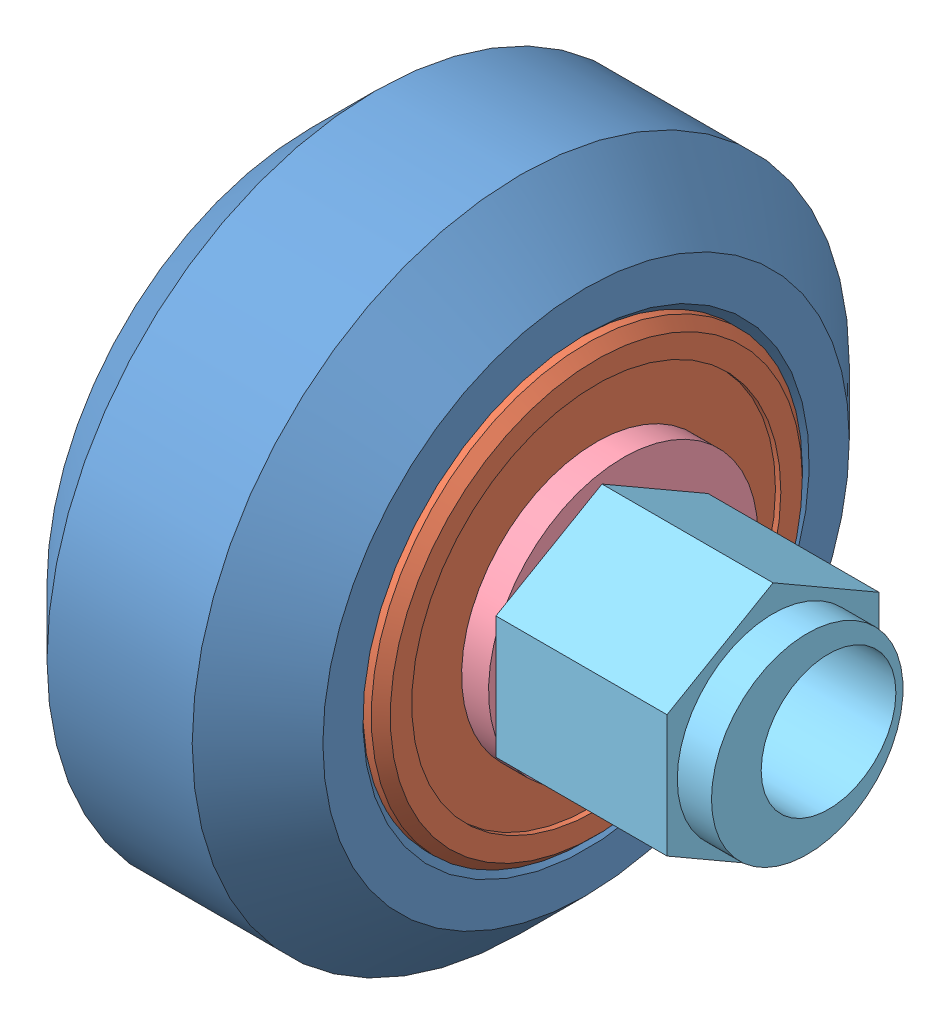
SolidWorks assembly solid v wheel assy, eccentric.sldasm, configuration Default (file format 4400). Lengths in mm.
Overall size (19.62 24.39 24.39).
6 component instances, 5 part files, 7 mates.
Components (placement in the parent):
- Solid V Wheel-1: Solid V Wheel.SLDPRT [Default] at (-14.5507 3.5936 5.2367) size (10.24 24.39 24.39)
- 625 2RS Bearing-2: 625 2RS Bearing.SLDPRT [Default] at (-11.5507 3.5936 5.2367) x (0 0.988225 0.153008) z (0 -0.153008 0.988225) size (16 5 16)
- Micro V Precision Shim-1: Micro V Precision Shim.SLDPRT [Default] at (-14.0507 3.5936 5.2367) x (0 0 1) z (-1 0 0) size (8 8 1)
- 625 2RS Bearing-4: 625 2RS Bearing.SLDPRT [Default] at (-17.5507 3.5936 5.2367) x (0 0.393113 0.91949) z (0 0.91949 -0.393113) size (16 5 16)
- 5mm Precision Washer-1: 5mm Precision Washer.SLDPRT [Default] at (-8.0507 3.5936 5.2367) x (0 0.329698 0.944086) z (-1 0 0) size (10 10 1)
- eccentric m5 spacer-1: eccentric m5 spacer.SLDPRT [Default] at (-8.0507 3.5936 6.0267) x (0 0 -1) z (1 0 0) size (7.87 9.09 7.62)
Mates (geometry in assembly coordinates):
- Concentric31: concentric anti-aligned: cylinder of 625 2RS Bearing-2 through (-13.9507 3.5936 5.2367) axis (1 0 0) radius 6.85; cylinder of Micro V Precision Shim-1 through (-14.0507 3.5936 5.2367) axis (-1 0 0) radius 4
- Coincident31: coincident anti-aligned: plane of 625 2RS Bearing-2 through (-14.0507 -3.5693 4.1277) normal (-1 0 0); plane of Micro V Precision Shim-1 through (-14.0507 3.5936 5.2367) normal (1 0 0)
- Concentric41: concentric anti-aligned: cylinder of Micro V Precision Shim-1 through (-14.0507 3.5936 5.2367) axis (-1 0 0) radius 4; cone of 625 2RS Bearing-4 through (-15.2275 3.5936 5.2367) axis (1 0 0)
- Coincident41: coincident anti-aligned: plane of Micro V Precision Shim-1 through (-15.0507 3.5936 5.2367) normal (-1 0 0); plane of 625 2RS Bearing-4 through (-15.0507 0.7443 -1.4279) normal (1 0 0)
- Concentric51: concentric aligned: cone of 625 2RS Bearing-2 through (-9.3007 3.5936 5.2367) axis (-1 0 0); cylinder of 5mm Precision Washer-1 through (-8.0507 3.5936 5.2367) axis (-1 0 0) radius 2.5
- Coincident51: coincident anti-aligned: plane of 625 2RS Bearing-2 through (-9.0507 -0.0134 4.6783) normal (1 0 0); plane of 5mm Precision Washer-1 through (-9.0507 3.5936 5.2367) normal (-1 0 0)
- Coincident54: coincident anti-aligned: circle of 5mm Precision Washer-1; circle of eccentric m5 spacer-1
